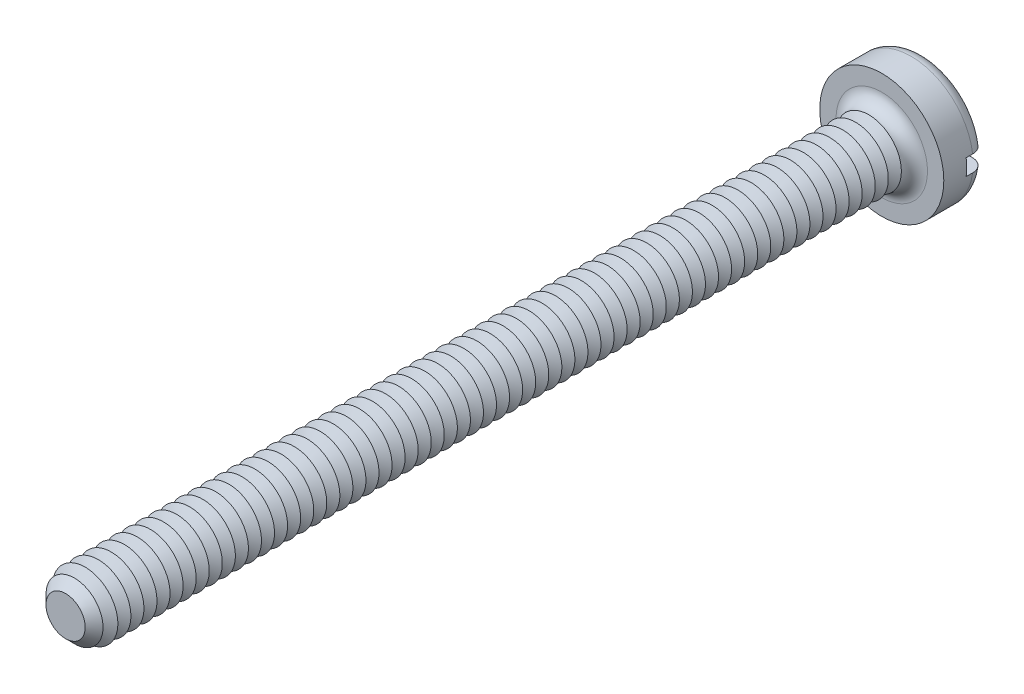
from build123d import *

# Parameters (mm, degrees)
SKETCH3_R           = 1.9
BOSS_EXTRUDE2_DEPTH = 1.3
SKETCH4_R           = 1
BOSS_EXTRUDE3_DEPTH = 25
FILLET1_R           = 0.4
CHAMFER1_SIZE       = 0.4
LPATTERN1_COUNT     = 61
LPATTERN1_PITCH     = 0.4
SKETCH8_W           = 3.8
SKETCH8_H           = 0.5
CUT_EXTRUDE1_DEPTH  = 0.6


with BuildPart() as part:
    # Sketch3 → Boss-Extrude2 (new body)
    with BuildSketch(Plane.XY):
        Circle(SKETCH3_R)
    extrude(amount=-BOSS_EXTRUDE2_DEPTH)

    # Sketch4 → Boss-Extrude3 (add)
    with BuildSketch(Plane.XY):
        Circle(SKETCH4_R)
    extrude(amount=BOSS_EXTRUDE3_DEPTH)

    # Fillet1
    fillet1_edges = [part.edges().sort_by_distance(p)[0] for p in [
        (-1.9, 0, -1.3),
        (-1, 0, 0),
    ]]
    fillet(fillet1_edges, radius=FILLET1_R)

    # Chamfer1
    chamfer1_edges = [part.edges().sort_by_distance(p)[0] for p in [
        (-1, 0, 25),
    ]]
    chamfer(chamfer1_edges, length=CHAMFER1_SIZE)

    # Sketch6 → Cut-Revolve1 (revolve, cut)
    with BuildSketch(Plane(origin=(0, 0, 0), x_dir=(0, 0, -1), z_dir=(1, 0, 0)), mode=Mode.PRIVATE) as cut_revolve1_sk:
        Polygon((-0.4, 1), (-0.6, 0.653589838), (-0.8, 1), align=None)
    cut_revolve1 = revolve(cut_revolve1_sk.sketch.rotate(Axis((0, 0, -1.694361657), (0, 0, 1)), 90), axis=Axis((0, 0, -1.694361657), (0, 0, 1)), mode=Mode.SUBTRACT)

    # LPattern1: Cut-Revolve1 ×61
    with Locations(*[(0, 0, i * LPATTERN1_PITCH) for i in range(1, LPATTERN1_COUNT)]):
        add(cut_revolve1, mode=Mode.SUBTRACT)

    # Sketch8 → Cut-Extrude1 (cut)
    with BuildSketch(Plane(origin=(0, 0, -1.3), x_dir=(-1, 0, 0), z_dir=(0, 0, -1))):
        Rectangle(SKETCH8_W, SKETCH8_H)
    extrude(amount=-CUT_EXTRUDE1_DEPTH, mode=Mode.SUBTRACT)


solid = part.part
